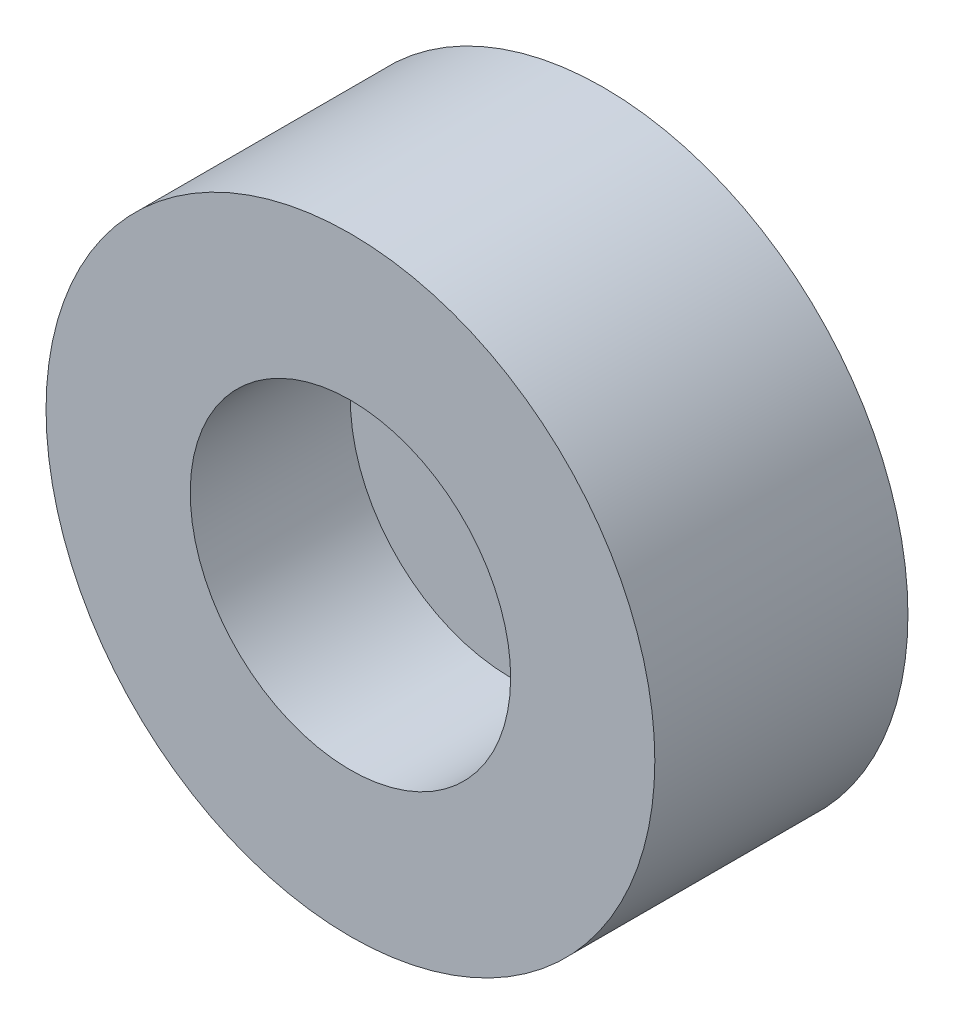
ISO-10303-21;
HEADER;
FILE_DESCRIPTION(('STEP AP214'),'2;1');
FILE_NAME('part.step','',(''),(''),'','','');
FILE_SCHEMA(('AUTOMOTIVE_DESIGN { 1 0 10303 214 1 1 1 1 }'));
ENDSEC;
DATA;
#1=APPLICATION_CONTEXT('core data for automotive mechanical design processes');
#2=APPLICATION_PROTOCOL_DEFINITION('international standard','automotive_design',2000,#1);
#3=PRODUCT_CONTEXT('',#1,'mechanical');
#4=PRODUCT('Part','Part','',(#3));
#5=PRODUCT_RELATED_PRODUCT_CATEGORY('part','',(#4));
#6=PRODUCT_DEFINITION_FORMATION('','',#4);
#7=PRODUCT_DEFINITION_CONTEXT('part definition',#1,'design');
#8=PRODUCT_DEFINITION('design','',#6,#7);
#9=PRODUCT_DEFINITION_SHAPE('','',#8);
#10=(LENGTH_UNIT() NAMED_UNIT(*) SI_UNIT(.MILLI.,.METRE.));
#11=(NAMED_UNIT(*) PLANE_ANGLE_UNIT() SI_UNIT($,.RADIAN.));
#12=(NAMED_UNIT(*) SI_UNIT($,.STERADIAN.) SOLID_ANGLE_UNIT());
#13=UNCERTAINTY_MEASURE_WITH_UNIT(LENGTH_MEASURE(1.E-05),#10,'distance_accuracy_value','');
#14=(GEOMETRIC_REPRESENTATION_CONTEXT(3) GLOBAL_UNCERTAINTY_ASSIGNED_CONTEXT((#13)) GLOBAL_UNIT_ASSIGNED_CONTEXT((#10,
#11,#12)) REPRESENTATION_CONTEXT('',''));
#15=CARTESIAN_POINT('',(0.,0.,0.));
#16=DIRECTION('',(0.,0.,1.));
#17=DIRECTION('',(1.,0.,0.));
#18=AXIS2_PLACEMENT_3D('',#15,#16,#17);
#19=CARTESIAN_POINT('',(2.35840467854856E-13,10.9999999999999,34.7700576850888));
#20=DIRECTION('',(0.,0.,-1.));
#21=DIRECTION('',(-1.,0.,0.));
#22=AXIS2_PLACEMENT_3D('',#19,#20,#21);
#23=CYLINDRICAL_SURFACE('',#22,5.);
#24=CARTESIAN_POINT('',(2.35840467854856E-13,10.9999999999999,7.9));
#25=DIRECTION('',(0.,0.,-1.));
#26=DIRECTION('',(0.,1.,0.));
#27=AXIS2_PLACEMENT_3D('',#24,#25,#26);
#28=CIRCLE('',#27,5.);
#29=CARTESIAN_POINT('',(2.35840467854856E-13,15.9999999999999,7.90000000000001));
#30=VERTEX_POINT('',#29);
#31=EDGE_CURVE('E10',#30,#30,#28,.T.);
#32=ORIENTED_EDGE('',*,*,#31,.F.);
#33=EDGE_LOOP('',(#32));
#34=FACE_BOUND('',#33,.T.);
#35=CARTESIAN_POINT('',(2.702322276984E-12,11.000000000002,2.9));
#36=DIRECTION('',(0.,0.,-1.));
#37=DIRECTION('',(-0.998036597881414,-0.0626334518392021,0.));
#38=AXIS2_PLACEMENT_3D('',#35,#36,#37);
#39=CIRCLE('',#38,5.);
#40=CARTESIAN_POINT('',(-4.99018298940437,10.686832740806,2.9));
#41=VERTEX_POINT('',#40);
#42=EDGE_CURVE('E46',#41,#41,#39,.T.);
#43=ORIENTED_EDGE('',*,*,#42,.T.);
#44=EDGE_LOOP('',(#43));
#45=FACE_BOUND('',#44,.T.);
#46=ADVANCED_FACE('F30',(#34,#45),#23,.F.);
#47=CARTESIAN_POINT('',(2.40362898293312E-13,10.9999999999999,0.));
#48=DIRECTION('',(0.,0.,1.));
#49=DIRECTION('',(1.,0.,0.));
#50=AXIS2_PLACEMENT_3D('',#47,#48,#49);
#51=PLANE('',#50);
#52=CARTESIAN_POINT('',(2.40362898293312E-13,10.9999999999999,0.));
#53=DIRECTION('',(0.,0.,1.));
#54=DIRECTION('',(1.,0.,0.));
#55=AXIS2_PLACEMENT_3D('',#52,#53,#54);
#56=CIRCLE('',#55,9.49999999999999);
#57=CARTESIAN_POINT('',(9.50000000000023,10.9999999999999,0.));
#58=VERTEX_POINT('',#57);
#59=EDGE_CURVE('E37',#58,#58,#56,.T.);
#60=ORIENTED_EDGE('',*,*,#59,.F.);
#61=EDGE_LOOP('',(#60));
#62=FACE_BOUND('',#61,.T.);
#63=ADVANCED_FACE('F61',(#62),#51,.F.);
#64=CARTESIAN_POINT('',(2.40362898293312E-13,10.9999999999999,34.7700576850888));
#65=DIRECTION('',(0.,0.,-1.));
#66=DIRECTION('',(-1.,0.,0.));
#67=AXIS2_PLACEMENT_3D('',#64,#65,#66);
#68=CYLINDRICAL_SURFACE('',#67,9.49999999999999);
#69=CARTESIAN_POINT('',(2.40362898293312E-13,10.9999999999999,7.9));
#70=DIRECTION('',(0.,0.,-1.));
#71=DIRECTION('',(0.,1.,0.));
#72=AXIS2_PLACEMENT_3D('',#69,#70,#71);
#73=CIRCLE('',#72,9.49999999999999);
#74=CARTESIAN_POINT('',(2.40362898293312E-13,20.4999999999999,7.90000000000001));
#75=VERTEX_POINT('',#74);
#76=EDGE_CURVE('E41',#75,#75,#73,.T.);
#77=ORIENTED_EDGE('',*,*,#76,.T.);
#78=EDGE_LOOP('',(#77));
#79=FACE_BOUND('',#78,.T.);
#80=ORIENTED_EDGE('',*,*,#59,.T.);
#81=EDGE_LOOP('',(#80));
#82=FACE_BOUND('',#81,.T.);
#83=ADVANCED_FACE('F58',(#79,#82),#68,.T.);
#84=CARTESIAN_POINT('',(2.70375755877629E-12,11.000000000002,7.9));
#85=DIRECTION('',(0.,0.,-1.));
#86=DIRECTION('',(-0.998036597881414,-0.0626334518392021,0.));
#87=AXIS2_PLACEMENT_3D('',#84,#85,#86);
#88=PLANE('',#87);
#89=ORIENTED_EDGE('',*,*,#31,.T.);
#90=EDGE_LOOP('',(#89));
#91=FACE_BOUND('',#90,.T.);
#92=ORIENTED_EDGE('',*,*,#76,.F.);
#93=EDGE_LOOP('',(#92));
#94=FACE_BOUND('',#93,.T.);
#95=ADVANCED_FACE('F32',(#91,#94),#88,.F.);
#96=CARTESIAN_POINT('',(2.702322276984E-12,11.000000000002,2.9));
#97=DIRECTION('',(0.,0.,-1.));
#98=DIRECTION('',(-0.998036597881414,-0.0626334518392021,0.));
#99=AXIS2_PLACEMENT_3D('',#96,#97,#98);
#100=PLANE('',#99);
#101=ORIENTED_EDGE('',*,*,#42,.F.);
#102=EDGE_LOOP('',(#101));
#103=FACE_BOUND('',#102,.T.);
#104=ADVANCED_FACE('F52',(#103),#100,.F.);
#105=CLOSED_SHELL('',(#46,#63,#83,#95,#104));
#106=MANIFOLD_SOLID_BREP('B2',#105);
#107=ADVANCED_BREP_SHAPE_REPRESENTATION('',(#18,#106),#14);
#108=SHAPE_DEFINITION_REPRESENTATION(#9,#107);
ENDSEC;
END-ISO-10303-21;
